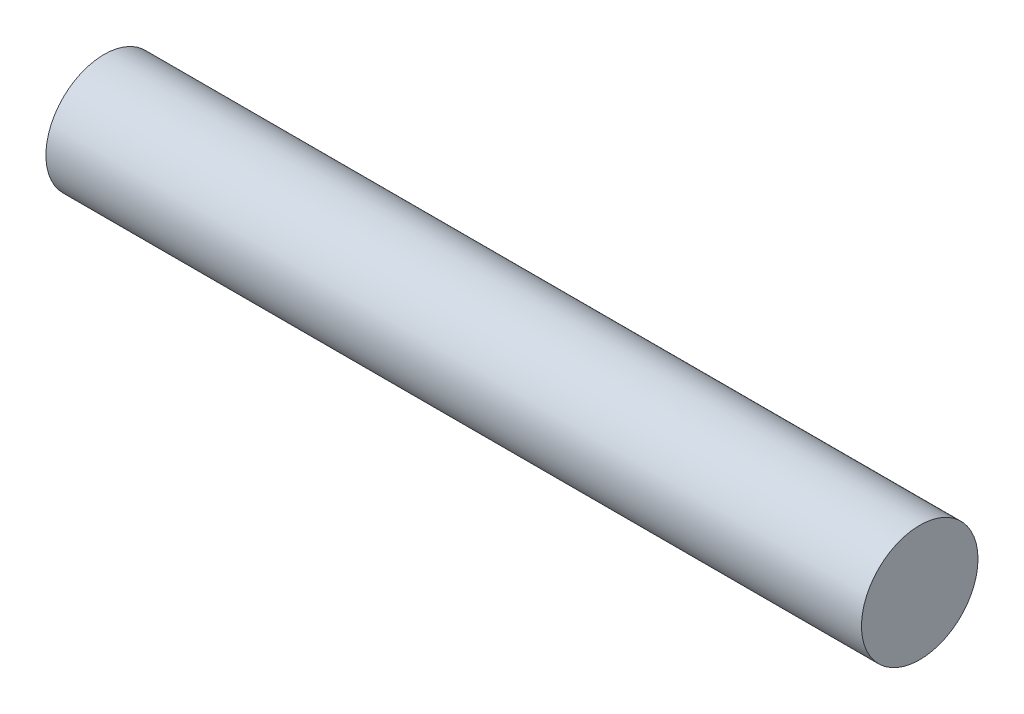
ISO-10303-21;
HEADER;
FILE_DESCRIPTION(('STEP AP214'),'2;1');
FILE_NAME('part.step','',(''),(''),'','','');
FILE_SCHEMA(('AUTOMOTIVE_DESIGN { 1 0 10303 214 1 1 1 1 }'));
ENDSEC;
DATA;
#1=APPLICATION_CONTEXT('core data for automotive mechanical design processes');
#2=APPLICATION_PROTOCOL_DEFINITION('international standard','automotive_design',2000,#1);
#3=PRODUCT_CONTEXT('',#1,'mechanical');
#4=PRODUCT('Part','Part','',(#3));
#5=PRODUCT_RELATED_PRODUCT_CATEGORY('part','',(#4));
#6=PRODUCT_DEFINITION_FORMATION('','',#4);
#7=PRODUCT_DEFINITION_CONTEXT('part definition',#1,'design');
#8=PRODUCT_DEFINITION('design','',#6,#7);
#9=PRODUCT_DEFINITION_SHAPE('','',#8);
#10=(LENGTH_UNIT() NAMED_UNIT(*) SI_UNIT(.MILLI.,.METRE.));
#11=(NAMED_UNIT(*) PLANE_ANGLE_UNIT() SI_UNIT($,.RADIAN.));
#12=(NAMED_UNIT(*) SI_UNIT($,.STERADIAN.) SOLID_ANGLE_UNIT());
#13=UNCERTAINTY_MEASURE_WITH_UNIT(LENGTH_MEASURE(1.E-05),#10,'distance_accuracy_value','');
#14=(GEOMETRIC_REPRESENTATION_CONTEXT(3) GLOBAL_UNCERTAINTY_ASSIGNED_CONTEXT((#13)) GLOBAL_UNIT_ASSIGNED_CONTEXT((#10,
#11,#12)) REPRESENTATION_CONTEXT('',''));
#15=CARTESIAN_POINT('',(0.,0.,0.));
#16=DIRECTION('',(0.,0.,1.));
#17=DIRECTION('',(1.,0.,0.));
#18=AXIS2_PLACEMENT_3D('',#15,#16,#17);
#19=CARTESIAN_POINT('',(70.,0.,0.));
#20=DIRECTION('',(-1.,0.,0.));
#21=DIRECTION('',(0.,0.,1.));
#22=AXIS2_PLACEMENT_3D('',#19,#20,#21);
#23=CYLINDRICAL_SURFACE('',#22,5.);
#24=CARTESIAN_POINT('',(70.,0.,0.));
#25=DIRECTION('',(1.,0.,0.));
#26=DIRECTION('',(0.,0.,-1.));
#27=AXIS2_PLACEMENT_3D('',#24,#25,#26);
#28=CIRCLE('',#27,5.);
#29=CARTESIAN_POINT('',(70.,0.,-5.));
#30=VERTEX_POINT('',#29);
#31=EDGE_CURVE('E10',#30,#30,#28,.T.);
#32=ORIENTED_EDGE('',*,*,#31,.F.);
#33=EDGE_LOOP('',(#32));
#34=FACE_BOUND('',#33,.T.);
#35=CARTESIAN_POINT('',(0.,0.,0.));
#36=DIRECTION('',(1.,0.,0.));
#37=DIRECTION('',(0.,0.,-1.));
#38=AXIS2_PLACEMENT_3D('',#35,#36,#37);
#39=CIRCLE('',#38,5.);
#40=CARTESIAN_POINT('',(0.,0.,-5.));
#41=VERTEX_POINT('',#40);
#42=EDGE_CURVE('E33',#41,#41,#39,.T.);
#43=ORIENTED_EDGE('',*,*,#42,.T.);
#44=EDGE_LOOP('',(#43));
#45=FACE_BOUND('',#44,.T.);
#46=ADVANCED_FACE('F30',(#34,#45),#23,.T.);
#47=CARTESIAN_POINT('',(70.,0.,0.));
#48=DIRECTION('',(1.,0.,0.));
#49=DIRECTION('',(0.,0.,-1.));
#50=AXIS2_PLACEMENT_3D('',#47,#48,#49);
#51=PLANE('',#50);
#52=ORIENTED_EDGE('',*,*,#31,.T.);
#53=EDGE_LOOP('',(#52));
#54=FACE_BOUND('',#53,.T.);
#55=ADVANCED_FACE('F45',(#54),#51,.T.);
#56=CARTESIAN_POINT('',(0.,0.,0.));
#57=DIRECTION('',(1.,0.,0.));
#58=DIRECTION('',(0.,0.,-1.));
#59=AXIS2_PLACEMENT_3D('',#56,#57,#58);
#60=PLANE('',#59);
#61=ORIENTED_EDGE('',*,*,#42,.F.);
#62=EDGE_LOOP('',(#61));
#63=FACE_BOUND('',#62,.T.);
#64=ADVANCED_FACE('F43',(#63),#60,.F.);
#65=CLOSED_SHELL('',(#46,#55,#64));
#66=MANIFOLD_SOLID_BREP('B2',#65);
#67=ADVANCED_BREP_SHAPE_REPRESENTATION('',(#18,#66),#14);
#68=SHAPE_DEFINITION_REPRESENTATION(#9,#67);
ENDSEC;
END-ISO-10303-21;
